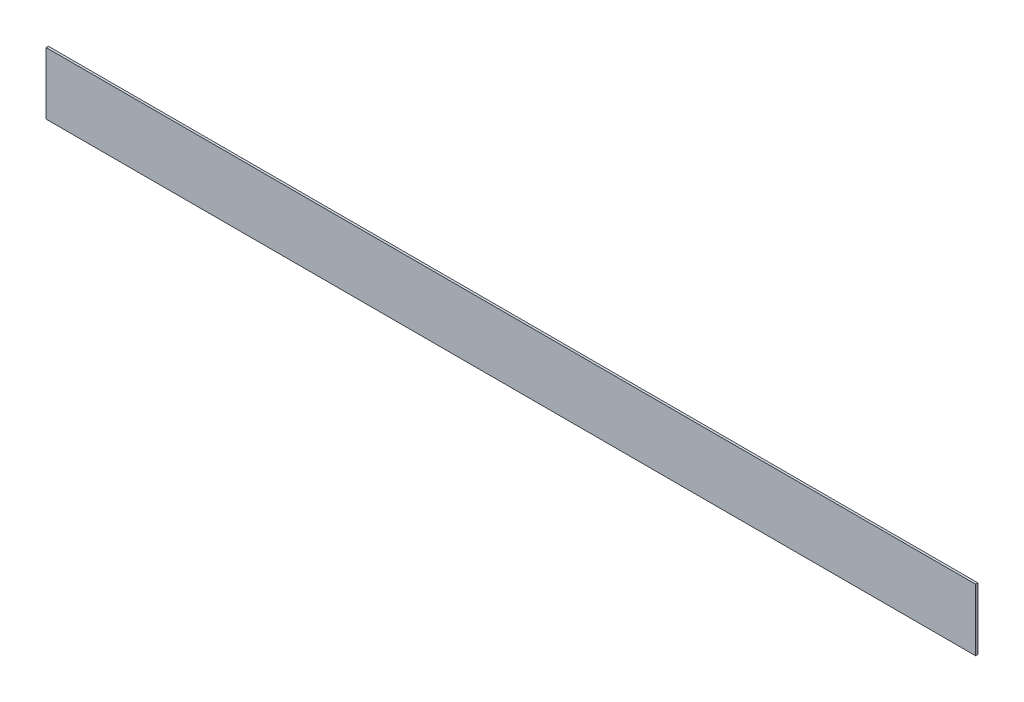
from build123d import *

# Parameters (mm, degrees)
SKETCH2_W           = 3048
SKETCH2_H           = 7.62
BOSS_EXTRUDE1_DEPTH = 203.2


with BuildPart() as part:
    # Sketch2 → Boss-Extrude1 (new body)
    with BuildSketch(Plane(origin=(0, 0, 0), x_dir=(1, 0, 0), z_dir=(0, 1, 0))):
        with Locations((1524, 3.81)):
            Rectangle(SKETCH2_W, SKETCH2_H)
    extrude(amount=-BOSS_EXTRUDE1_DEPTH)


solid = part.part
